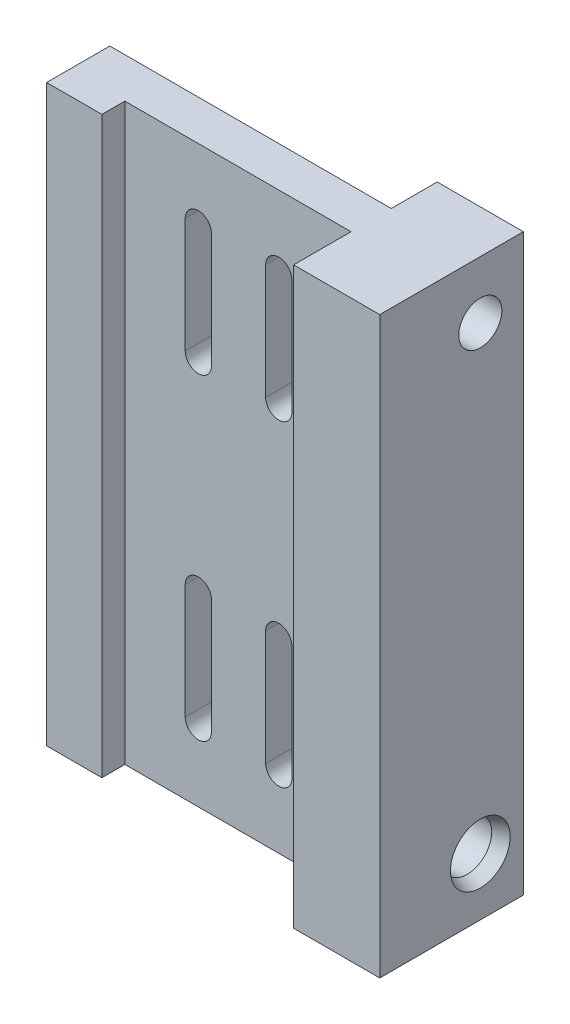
ISO-10303-21;
HEADER;
FILE_DESCRIPTION(('STEP AP214'),'2;1');
FILE_NAME('part.step','',(''),(''),'','','');
FILE_SCHEMA(('AUTOMOTIVE_DESIGN { 1 0 10303 214 1 1 1 1 }'));
ENDSEC;
DATA;
#1=APPLICATION_CONTEXT('core data for automotive mechanical design processes');
#2=APPLICATION_PROTOCOL_DEFINITION('international standard','automotive_design',2000,#1);
#3=PRODUCT_CONTEXT('',#1,'mechanical');
#4=PRODUCT('Part','Part','',(#3));
#5=PRODUCT_RELATED_PRODUCT_CATEGORY('part','',(#4));
#6=PRODUCT_DEFINITION_FORMATION('','',#4);
#7=PRODUCT_DEFINITION_CONTEXT('part definition',#1,'design');
#8=PRODUCT_DEFINITION('design','',#6,#7);
#9=PRODUCT_DEFINITION_SHAPE('','',#8);
#10=(LENGTH_UNIT() NAMED_UNIT(*) SI_UNIT(.MILLI.,.METRE.));
#11=(NAMED_UNIT(*) PLANE_ANGLE_UNIT() SI_UNIT($,.RADIAN.));
#12=(NAMED_UNIT(*) SI_UNIT($,.STERADIAN.) SOLID_ANGLE_UNIT());
#13=UNCERTAINTY_MEASURE_WITH_UNIT(LENGTH_MEASURE(1.E-05),#10,'distance_accuracy_value','');
#14=(GEOMETRIC_REPRESENTATION_CONTEXT(3) GLOBAL_UNCERTAINTY_ASSIGNED_CONTEXT((#13)) GLOBAL_UNIT_ASSIGNED_CONTEXT((#10,
#11,#12)) REPRESENTATION_CONTEXT('',''));
#15=CARTESIAN_POINT('',(0.,0.,0.));
#16=DIRECTION('',(0.,0.,1.));
#17=DIRECTION('',(1.,0.,0.));
#18=AXIS2_PLACEMENT_3D('',#15,#16,#17);
#19=CARTESIAN_POINT('',(-14.22869011,14.224,15.875));
#20=DIRECTION('',(0.,-1.,0.));
#21=DIRECTION('',(1.,0.,0.));
#22=AXIS2_PLACEMENT_3D('',#19,#20,#21);
#23=PLANE('',#22);
#24=DIRECTION('',(-1.,0.,0.));
#25=VECTOR('',#24,1.);
#26=CARTESIAN_POINT('',(-14.22869011,14.224,12.065));
#27=LINE('',#26,#25);
#28=CARTESIAN_POINT('',(-8.12131011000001,14.224,12.065));
#29=VERTEX_POINT('',#28);
#30=CARTESIAN_POINT('',(-14.22869011,14.224,12.065));
#31=VERTEX_POINT('',#30);
#32=EDGE_CURVE('E234',#29,#31,#27,.T.);
#33=ORIENTED_EDGE('',*,*,#32,.F.);
#34=DIRECTION('',(0.,0.,1.));
#35=VECTOR('',#34,1.);
#36=CARTESIAN_POINT('',(-8.12131011,14.224,15.875));
#37=LINE('',#36,#35);
#38=CARTESIAN_POINT('',(-8.12131011,14.224,9.525));
#39=VERTEX_POINT('',#38);
#40=EDGE_CURVE('E388',#39,#29,#37,.T.);
#41=ORIENTED_EDGE('',*,*,#40,.F.);
#42=DIRECTION('',(-1.,0.,0.));
#43=VECTOR('',#42,1.);
#44=CARTESIAN_POINT('',(-8.12131011,14.224,9.525));
#45=LINE('',#44,#43);
#46=CARTESIAN_POINT('',(16.87868989,14.224,9.525));
#47=VERTEX_POINT('',#46);
#48=EDGE_CURVE('E397',#47,#39,#45,.T.);
#49=ORIENTED_EDGE('',*,*,#48,.F.);
#50=DIRECTION('',(0.,0.,-1.));
#51=VECTOR('',#50,1.);
#52=CARTESIAN_POINT('',(16.87868989,14.224,15.875));
#53=LINE('',#52,#51);
#54=CARTESIAN_POINT('',(16.87868989,14.224,15.875));
#55=VERTEX_POINT('',#54);
#56=EDGE_CURVE('E393',#55,#47,#53,.T.);
#57=ORIENTED_EDGE('',*,*,#56,.F.);
#58=DIRECTION('',(-1.,0.,0.));
#59=VECTOR('',#58,1.);
#60=CARTESIAN_POINT('',(-14.22869011,14.224,15.875));
#61=LINE('',#60,#59);
#62=CARTESIAN_POINT('',(26.40368989,14.224,15.875));
#63=VERTEX_POINT('',#62);
#64=EDGE_CURVE('E493',#63,#55,#61,.T.);
#65=ORIENTED_EDGE('',*,*,#64,.F.);
#66=DIRECTION('',(0.,0.,-1.));
#67=VECTOR('',#66,1.);
#68=CARTESIAN_POINT('',(26.40368989,14.224,15.875));
#69=LINE('',#68,#67);
#70=CARTESIAN_POINT('',(26.40368989,14.224,0.));
#71=VERTEX_POINT('',#70);
#72=EDGE_CURVE('E257',#63,#71,#69,.T.);
#73=ORIENTED_EDGE('',*,*,#72,.T.);
#74=DIRECTION('',(-1.,0.,0.));
#75=VECTOR('',#74,1.);
#76=CARTESIAN_POINT('',(-14.22869011,14.224,0.));
#77=LINE('',#76,#75);
#78=CARTESIAN_POINT('',(16.87868989,14.224,0.));
#79=VERTEX_POINT('',#78);
#80=EDGE_CURVE('E500',#71,#79,#77,.T.);
#81=ORIENTED_EDGE('',*,*,#80,.T.);
#82=DIRECTION('',(0.,0.,-1.));
#83=VECTOR('',#82,1.);
#84=CARTESIAN_POINT('',(16.87868989,14.224,0.));
#85=LINE('',#84,#83);
#86=CARTESIAN_POINT('',(16.87868989,14.224,5.08));
#87=VERTEX_POINT('',#86);
#88=EDGE_CURVE('E560',#87,#79,#85,.T.);
#89=ORIENTED_EDGE('',*,*,#88,.F.);
#90=DIRECTION('',(1.,0.,0.));
#91=VECTOR('',#90,1.);
#92=CARTESIAN_POINT('',(16.87868989,14.224,5.08));
#93=LINE('',#92,#91);
#94=CARTESIAN_POINT('',(-14.22869011,14.224,5.08));
#95=VERTEX_POINT('',#94);
#96=EDGE_CURVE('E557',#95,#87,#93,.T.);
#97=ORIENTED_EDGE('',*,*,#96,.F.);
#98=DIRECTION('',(0.,0.,-1.));
#99=VECTOR('',#98,1.);
#100=CARTESIAN_POINT('',(-14.22869011,14.224,15.875));
#101=LINE('',#100,#99);
#102=EDGE_CURVE('E254',#31,#95,#101,.T.);
#103=ORIENTED_EDGE('',*,*,#102,.F.);
#104=EDGE_LOOP('',(#33,#41,#49,#57,#65,#73,#81,#89,#97,#103));
#105=FACE_BOUND('',#104,.T.);
#106=ADVANCED_FACE('F42',(#105),#23,.F.);
#107=CARTESIAN_POINT('',(-14.22869011,14.224,15.875));
#108=DIRECTION('',(1.,0.,0.));
#109=DIRECTION('',(0.,1.,0.));
#110=AXIS2_PLACEMENT_3D('',#107,#108,#109);
#111=PLANE('',#110);
#112=DIRECTION('',(0.,-1.,0.));
#113=VECTOR('',#112,1.);
#114=CARTESIAN_POINT('',(-14.22869011,14.224,12.065));
#115=LINE('',#114,#113);
#116=CARTESIAN_POINT('',(-14.22869011,-49.276,12.065));
#117=VERTEX_POINT('',#116);
#118=EDGE_CURVE('E231',#31,#117,#115,.T.);
#119=ORIENTED_EDGE('',*,*,#118,.F.);
#120=ORIENTED_EDGE('',*,*,#102,.T.);
#121=DIRECTION('',(0.,1.,0.));
#122=VECTOR('',#121,1.);
#123=CARTESIAN_POINT('',(-14.22869011,-49.276,5.08));
#124=LINE('',#123,#122);
#125=CARTESIAN_POINT('',(-14.22869011,-49.276,5.08));
#126=VERTEX_POINT('',#125);
#127=EDGE_CURVE('E253',#126,#95,#124,.T.);
#128=ORIENTED_EDGE('',*,*,#127,.F.);
#129=DIRECTION('',(0.,0.,-1.));
#130=VECTOR('',#129,1.);
#131=CARTESIAN_POINT('',(-14.22869011,-49.276,15.875));
#132=LINE('',#131,#130);
#133=EDGE_CURVE('E243',#117,#126,#132,.T.);
#134=ORIENTED_EDGE('',*,*,#133,.F.);
#135=EDGE_LOOP('',(#119,#120,#128,#134));
#136=FACE_BOUND('',#135,.T.);
#137=ADVANCED_FACE('F251',(#136),#111,.F.);
#138=CARTESIAN_POINT('',(-14.22869011,-49.276,15.875));
#139=DIRECTION('',(0.,1.,0.));
#140=DIRECTION('',(-1.,0.,0.));
#141=AXIS2_PLACEMENT_3D('',#138,#139,#140);
#142=PLANE('',#141);
#143=DIRECTION('',(1.,0.,0.));
#144=VECTOR('',#143,1.);
#145=CARTESIAN_POINT('',(-14.22869011,-49.276,12.065));
#146=LINE('',#145,#144);
#147=CARTESIAN_POINT('',(-8.12131011,-49.276,12.065));
#148=VERTEX_POINT('',#147);
#149=EDGE_CURVE('E57',#117,#148,#146,.T.);
#150=ORIENTED_EDGE('',*,*,#149,.F.);
#151=ORIENTED_EDGE('',*,*,#133,.T.);
#152=DIRECTION('',(1.,0.,0.));
#153=VECTOR('',#152,1.);
#154=CARTESIAN_POINT('',(16.87868989,-49.276,5.08));
#155=LINE('',#154,#153);
#156=CARTESIAN_POINT('',(16.87868989,-49.276,5.08));
#157=VERTEX_POINT('',#156);
#158=EDGE_CURVE('E550',#126,#157,#155,.T.);
#159=ORIENTED_EDGE('',*,*,#158,.T.);
#160=DIRECTION('',(0.,0.,-1.));
#161=VECTOR('',#160,1.);
#162=CARTESIAN_POINT('',(16.87868989,-49.276,0.));
#163=LINE('',#162,#161);
#164=CARTESIAN_POINT('',(16.87868989,-49.276,0.));
#165=VERTEX_POINT('',#164);
#166=EDGE_CURVE('E507',#157,#165,#163,.T.);
#167=ORIENTED_EDGE('',*,*,#166,.T.);
#168=DIRECTION('',(1.,0.,0.));
#169=VECTOR('',#168,1.);
#170=CARTESIAN_POINT('',(-14.22869011,-49.276,0.));
#171=LINE('',#170,#169);
#172=CARTESIAN_POINT('',(26.40368989,-49.276,0.));
#173=VERTEX_POINT('',#172);
#174=EDGE_CURVE('E494',#165,#173,#171,.T.);
#175=ORIENTED_EDGE('',*,*,#174,.T.);
#176=DIRECTION('',(0.,0.,-1.));
#177=VECTOR('',#176,1.);
#178=CARTESIAN_POINT('',(26.40368989,-49.276,15.875));
#179=LINE('',#178,#177);
#180=CARTESIAN_POINT('',(26.40368989,-49.276,15.875));
#181=VERTEX_POINT('',#180);
#182=EDGE_CURVE('E255',#181,#173,#179,.T.);
#183=ORIENTED_EDGE('',*,*,#182,.F.);
#184=DIRECTION('',(1.,0.,0.));
#185=VECTOR('',#184,1.);
#186=CARTESIAN_POINT('',(-14.22869011,-49.276,15.875));
#187=LINE('',#186,#185);
#188=CARTESIAN_POINT('',(16.87868989,-49.276,15.875));
#189=VERTEX_POINT('',#188);
#190=EDGE_CURVE('E260',#189,#181,#187,.T.);
#191=ORIENTED_EDGE('',*,*,#190,.F.);
#192=DIRECTION('',(0.,0.,-1.));
#193=VECTOR('',#192,1.);
#194=CARTESIAN_POINT('',(16.87868989,-49.276,15.875));
#195=LINE('',#194,#193);
#196=CARTESIAN_POINT('',(16.87868989,-49.276,9.525));
#197=VERTEX_POINT('',#196);
#198=EDGE_CURVE('E517',#189,#197,#195,.T.);
#199=ORIENTED_EDGE('',*,*,#198,.T.);
#200=DIRECTION('',(-1.,0.,0.));
#201=VECTOR('',#200,1.);
#202=CARTESIAN_POINT('',(-8.12131011,-49.276,9.525));
#203=LINE('',#202,#201);
#204=CARTESIAN_POINT('',(-8.12131011,-49.276,9.525));
#205=VERTEX_POINT('',#204);
#206=EDGE_CURVE('E402',#197,#205,#203,.T.);
#207=ORIENTED_EDGE('',*,*,#206,.T.);
#208=DIRECTION('',(0.,0.,1.));
#209=VECTOR('',#208,1.);
#210=CARTESIAN_POINT('',(-8.12131011,-49.276,15.875));
#211=LINE('',#210,#209);
#212=EDGE_CURVE('E247',#205,#148,#211,.T.);
#213=ORIENTED_EDGE('',*,*,#212,.T.);
#214=EDGE_LOOP('',(#150,#151,#159,#167,#175,#183,#191,#199,#207,#213));
#215=FACE_BOUND('',#214,.T.);
#216=ADVANCED_FACE('F241',(#215),#142,.F.);
#217=CARTESIAN_POINT('',(-8.12131011,-49.276,15.875));
#218=DIRECTION('',(-1.,0.,0.));
#219=DIRECTION('',(0.,0.,1.));
#220=AXIS2_PLACEMENT_3D('',#217,#218,#219);
#221=PLANE('',#220);
#222=DIRECTION('',(0.,1.,0.));
#223=VECTOR('',#222,1.);
#224=CARTESIAN_POINT('',(-8.12131011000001,14.224,12.065));
#225=LINE('',#224,#223);
#226=EDGE_CURVE('E248',#148,#29,#225,.T.);
#227=ORIENTED_EDGE('',*,*,#226,.F.);
#228=ORIENTED_EDGE('',*,*,#212,.F.);
#229=DIRECTION('',(0.,1.,0.));
#230=VECTOR('',#229,1.);
#231=CARTESIAN_POINT('',(-8.12131011,-49.276,9.525));
#232=LINE('',#231,#230);
#233=EDGE_CURVE('E391',#205,#39,#232,.T.);
#234=ORIENTED_EDGE('',*,*,#233,.T.);
#235=ORIENTED_EDGE('',*,*,#40,.T.);
#236=EDGE_LOOP('',(#227,#228,#234,#235));
#237=FACE_BOUND('',#236,.T.);
#238=ADVANCED_FACE('F303',(#237),#221,.F.);
#239=CARTESIAN_POINT('',(26.40368989,-49.276,15.875));
#240=DIRECTION('',(0.,0.,1.));
#241=DIRECTION('',(1.,0.,0.));
#242=AXIS2_PLACEMENT_3D('',#239,#240,#241);
#243=PLANE('',#242);
#244=DIRECTION('',(0.,1.,0.));
#245=VECTOR('',#244,1.);
#246=CARTESIAN_POINT('',(16.87868989,-49.276,15.875));
#247=LINE('',#246,#245);
#248=EDGE_CURVE('E410',#189,#55,#247,.T.);
#249=ORIENTED_EDGE('',*,*,#248,.F.);
#250=ORIENTED_EDGE('',*,*,#190,.T.);
#251=DIRECTION('',(0.,1.,0.));
#252=VECTOR('',#251,1.);
#253=CARTESIAN_POINT('',(26.40368989,14.224,15.875));
#254=LINE('',#253,#252);
#255=EDGE_CURVE('E490',#181,#63,#254,.T.);
#256=ORIENTED_EDGE('',*,*,#255,.T.);
#257=ORIENTED_EDGE('',*,*,#64,.T.);
#258=EDGE_LOOP('',(#249,#250,#256,#257));
#259=FACE_BOUND('',#258,.T.);
#260=ADVANCED_FACE('F306',(#259),#243,.T.);
#261=CARTESIAN_POINT('',(26.40368989,-49.276,0.));
#262=DIRECTION('',(0.,0.,1.));
#263=DIRECTION('',(1.,0.,0.));
#264=AXIS2_PLACEMENT_3D('',#261,#262,#263);
#265=PLANE('',#264);
#266=ORIENTED_EDGE('',*,*,#174,.F.);
#267=DIRECTION('',(0.,1.,0.));
#268=VECTOR('',#267,1.);
#269=CARTESIAN_POINT('',(16.87868989,-49.276,0.));
#270=LINE('',#269,#268);
#271=EDGE_CURVE('E512',#165,#79,#270,.T.);
#272=ORIENTED_EDGE('',*,*,#271,.T.);
#273=ORIENTED_EDGE('',*,*,#80,.F.);
#274=DIRECTION('',(0.,1.,0.));
#275=VECTOR('',#274,1.);
#276=CARTESIAN_POINT('',(26.40368989,14.224,0.));
#277=LINE('',#276,#275);
#278=EDGE_CURVE('E489',#173,#71,#277,.T.);
#279=ORIENTED_EDGE('',*,*,#278,.F.);
#280=EDGE_LOOP('',(#266,#272,#273,#279));
#281=FACE_BOUND('',#280,.T.);
#282=ADVANCED_FACE('F373',(#281),#265,.F.);
#283=CARTESIAN_POINT('',(26.40368989,14.224,15.875));
#284=DIRECTION('',(-1.,0.,0.));
#285=DIRECTION('',(0.,-1.,0.));
#286=AXIS2_PLACEMENT_3D('',#283,#284,#285);
#287=PLANE('',#286);
#288=CARTESIAN_POINT('',(26.40368989,-42.926,4.7625));
#289=DIRECTION('',(1.,0.,0.));
#290=DIRECTION('',(0.,0.,-1.));
#291=AXIS2_PLACEMENT_3D('',#288,#289,#290);
#292=CIRCLE('',#291,3.302);
#293=CARTESIAN_POINT('',(26.40368989,-42.926,1.4605));
#294=VERTEX_POINT('',#293);
#295=EDGE_CURVE('E574',#294,#294,#292,.T.);
#296=ORIENTED_EDGE('',*,*,#295,.F.);
#297=EDGE_LOOP('',(#296));
#298=FACE_BOUND('',#297,.T.);
#299=CARTESIAN_POINT('',(26.40368989,7.874,4.7625));
#300=DIRECTION('',(1.,0.,0.));
#301=DIRECTION('',(0.,1.,0.));
#302=AXIS2_PLACEMENT_3D('',#299,#300,#301);
#303=CIRCLE('',#302,2.38125);
#304=CARTESIAN_POINT('',(26.40368989,10.25525,4.7625));
#305=VERTEX_POINT('',#304);
#306=EDGE_CURVE('E568',#305,#305,#303,.T.);
#307=ORIENTED_EDGE('',*,*,#306,.F.);
#308=EDGE_LOOP('',(#307));
#309=FACE_BOUND('',#308,.T.);
#310=ORIENTED_EDGE('',*,*,#278,.T.);
#311=ORIENTED_EDGE('',*,*,#72,.F.);
#312=ORIENTED_EDGE('',*,*,#255,.F.);
#313=ORIENTED_EDGE('',*,*,#182,.T.);
#314=EDGE_LOOP('',(#310,#311,#312,#313));
#315=FACE_BOUND('',#314,.T.);
#316=ADVANCED_FACE('F44',(#298,#309,#315),#287,.F.);
#317=CARTESIAN_POINT('',(8.890000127,6.35,15.875));
#318=DIRECTION('',(0.,0.,-1.));
#319=DIRECTION('',(-1.,0.,0.));
#320=AXIS2_PLACEMENT_3D('',#317,#318,#319);
#321=CYLINDRICAL_SURFACE('',#320,1.450000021);
#322=CARTESIAN_POINT('',(8.890000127,6.35,5.08));
#323=DIRECTION('',(0.,0.,1.));
#324=DIRECTION('',(1.,0.,0.));
#325=AXIS2_PLACEMENT_3D('',#322,#323,#324);
#326=CIRCLE('',#325,1.450000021);
#327=CARTESIAN_POINT('',(10.340000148,6.35,5.08));
#328=VERTEX_POINT('',#327);
#329=CARTESIAN_POINT('',(7.440000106,6.35,5.08));
#330=VERTEX_POINT('',#329);
#331=EDGE_CURVE('E394',#328,#330,#326,.T.);
#332=ORIENTED_EDGE('',*,*,#331,.F.);
#333=DIRECTION('',(0.,0.,-1.));
#334=VECTOR('',#333,1.);
#335=CARTESIAN_POINT('',(10.340000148,6.35,15.875));
#336=LINE('',#335,#334);
#337=CARTESIAN_POINT('',(10.340000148,6.35,9.525));
#338=VERTEX_POINT('',#337);
#339=EDGE_CURVE('E477',#338,#328,#336,.T.);
#340=ORIENTED_EDGE('',*,*,#339,.F.);
#341=CARTESIAN_POINT('',(8.890000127,6.35,9.525));
#342=DIRECTION('',(0.,0.,-1.));
#343=DIRECTION('',(-1.,0.,0.));
#344=AXIS2_PLACEMENT_3D('',#341,#342,#343);
#345=CIRCLE('',#344,1.450000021);
#346=CARTESIAN_POINT('',(7.440000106,6.35,9.525));
#347=VERTEX_POINT('',#346);
#348=EDGE_CURVE('E439',#347,#338,#345,.T.);
#349=ORIENTED_EDGE('',*,*,#348,.F.);
#350=DIRECTION('',(0.,0.,-1.));
#351=VECTOR('',#350,1.);
#352=CARTESIAN_POINT('',(7.440000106,6.35,15.875));
#353=LINE('',#352,#351);
#354=EDGE_CURVE('E486',#347,#330,#353,.T.);
#355=ORIENTED_EDGE('',*,*,#354,.T.);
#356=EDGE_LOOP('',(#332,#340,#349,#355));
#357=FACE_BOUND('',#356,.T.);
#358=ADVANCED_FACE('F366',(#357),#321,.F.);
#359=CARTESIAN_POINT('',(7.440000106,6.35,15.875));
#360=DIRECTION('',(1.,0.,0.));
#361=DIRECTION('',(0.,0.,-1.));
#362=AXIS2_PLACEMENT_3D('',#359,#360,#361);
#363=PLANE('',#362);
#364=DIRECTION('',(0.,-1.,0.));
#365=VECTOR('',#364,1.);
#366=CARTESIAN_POINT('',(7.440000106,6.35,5.08));
#367=LINE('',#366,#365);
#368=CARTESIAN_POINT('',(7.440000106,-6.35,5.08));
#369=VERTEX_POINT('',#368);
#370=EDGE_CURVE('E399',#330,#369,#367,.T.);
#371=ORIENTED_EDGE('',*,*,#370,.F.);
#372=ORIENTED_EDGE('',*,*,#354,.F.);
#373=DIRECTION('',(0.,1.,0.));
#374=VECTOR('',#373,1.);
#375=CARTESIAN_POINT('',(7.440000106,6.35,9.525));
#376=LINE('',#375,#374);
#377=CARTESIAN_POINT('',(7.440000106,-6.35,9.525));
#378=VERTEX_POINT('',#377);
#379=EDGE_CURVE('E437',#378,#347,#376,.T.);
#380=ORIENTED_EDGE('',*,*,#379,.F.);
#381=DIRECTION('',(0.,0.,-1.));
#382=VECTOR('',#381,1.);
#383=CARTESIAN_POINT('',(7.440000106,-6.35,15.875));
#384=LINE('',#383,#382);
#385=EDGE_CURVE('E483',#378,#369,#384,.T.);
#386=ORIENTED_EDGE('',*,*,#385,.T.);
#387=EDGE_LOOP('',(#371,#372,#380,#386));
#388=FACE_BOUND('',#387,.T.);
#389=ADVANCED_FACE('F362',(#388),#363,.T.);
#390=CARTESIAN_POINT('',(8.890000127,-6.35,15.875));
#391=DIRECTION('',(0.,0.,-1.));
#392=DIRECTION('',(-1.,0.,0.));
#393=AXIS2_PLACEMENT_3D('',#390,#391,#392);
#394=CYLINDRICAL_SURFACE('',#393,1.450000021);
#395=CARTESIAN_POINT('',(8.890000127,-6.35,5.08));
#396=DIRECTION('',(0.,0.,1.));
#397=DIRECTION('',(1.,0.,0.));
#398=AXIS2_PLACEMENT_3D('',#395,#396,#397);
#399=CIRCLE('',#398,1.450000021);
#400=CARTESIAN_POINT('',(10.340000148,-6.35,5.08));
#401=VERTEX_POINT('',#400);
#402=EDGE_CURVE('E522',#369,#401,#399,.T.);
#403=ORIENTED_EDGE('',*,*,#402,.F.);
#404=ORIENTED_EDGE('',*,*,#385,.F.);
#405=CARTESIAN_POINT('',(8.890000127,-6.35,9.525));
#406=DIRECTION('',(0.,0.,-1.));
#407=DIRECTION('',(-1.,0.,0.));
#408=AXIS2_PLACEMENT_3D('',#405,#406,#407);
#409=CIRCLE('',#408,1.450000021);
#410=CARTESIAN_POINT('',(10.340000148,-6.35,9.525));
#411=VERTEX_POINT('',#410);
#412=EDGE_CURVE('E435',#411,#378,#409,.T.);
#413=ORIENTED_EDGE('',*,*,#412,.F.);
#414=DIRECTION('',(0.,0.,-1.));
#415=VECTOR('',#414,1.);
#416=CARTESIAN_POINT('',(10.340000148,-6.35,15.875));
#417=LINE('',#416,#415);
#418=EDGE_CURVE('E480',#411,#401,#417,.T.);
#419=ORIENTED_EDGE('',*,*,#418,.T.);
#420=EDGE_LOOP('',(#403,#404,#413,#419));
#421=FACE_BOUND('',#420,.T.);
#422=ADVANCED_FACE('F358',(#421),#394,.F.);
#423=CARTESIAN_POINT('',(10.340000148,6.35,15.875));
#424=DIRECTION('',(-1.,0.,0.));
#425=DIRECTION('',(0.,0.,1.));
#426=AXIS2_PLACEMENT_3D('',#423,#424,#425);
#427=PLANE('',#426);
#428=DIRECTION('',(0.,1.,0.));
#429=VECTOR('',#428,1.);
#430=CARTESIAN_POINT('',(10.340000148,6.35,5.08));
#431=LINE('',#430,#429);
#432=EDGE_CURVE('E524',#401,#328,#431,.T.);
#433=ORIENTED_EDGE('',*,*,#432,.F.);
#434=ORIENTED_EDGE('',*,*,#418,.F.);
#435=DIRECTION('',(0.,-1.,0.));
#436=VECTOR('',#435,1.);
#437=CARTESIAN_POINT('',(10.340000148,6.35,9.525));
#438=LINE('',#437,#436);
#439=EDGE_CURVE('E433',#338,#411,#438,.T.);
#440=ORIENTED_EDGE('',*,*,#439,.F.);
#441=ORIENTED_EDGE('',*,*,#339,.T.);
#442=EDGE_LOOP('',(#433,#434,#440,#441));
#443=FACE_BOUND('',#442,.T.);
#444=ADVANCED_FACE('F354',(#443),#427,.T.);
#445=CARTESIAN_POINT('',(1.27000368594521E-07,-28.702,15.875));
#446=DIRECTION('',(0.,0.,-1.));
#447=DIRECTION('',(-1.,0.,0.));
#448=AXIS2_PLACEMENT_3D('',#445,#446,#447);
#449=CYLINDRICAL_SURFACE('',#448,1.450000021);
#450=CARTESIAN_POINT('',(1.27000368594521E-07,-28.702,5.08));
#451=DIRECTION('',(0.,0.,1.));
#452=DIRECTION('',(1.,0.,0.));
#453=AXIS2_PLACEMENT_3D('',#450,#451,#452);
#454=CIRCLE('',#453,1.450000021);
#455=CARTESIAN_POINT('',(1.45000014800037,-28.702,5.08));
#456=VERTEX_POINT('',#455);
#457=CARTESIAN_POINT('',(-1.44999989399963,-28.702,5.08));
#458=VERTEX_POINT('',#457);
#459=EDGE_CURVE('E526',#456,#458,#454,.T.);
#460=ORIENTED_EDGE('',*,*,#459,.F.);
#461=DIRECTION('',(0.,0.,-1.));
#462=VECTOR('',#461,1.);
#463=CARTESIAN_POINT('',(1.45000014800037,-28.702,15.875));
#464=LINE('',#463,#462);
#465=CARTESIAN_POINT('',(1.45000014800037,-28.702,9.525));
#466=VERTEX_POINT('',#465);
#467=EDGE_CURVE('E465',#466,#456,#464,.T.);
#468=ORIENTED_EDGE('',*,*,#467,.F.);
#469=CARTESIAN_POINT('',(1.27000368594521E-07,-28.702,9.525));
#470=DIRECTION('',(0.,0.,-1.));
#471=DIRECTION('',(-1.,0.,0.));
#472=AXIS2_PLACEMENT_3D('',#469,#470,#471);
#473=CIRCLE('',#472,1.450000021);
#474=CARTESIAN_POINT('',(-1.44999989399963,-28.702,9.525));
#475=VERTEX_POINT('',#474);
#476=EDGE_CURVE('E431',#475,#466,#473,.T.);
#477=ORIENTED_EDGE('',*,*,#476,.F.);
#478=DIRECTION('',(0.,0.,-1.));
#479=VECTOR('',#478,1.);
#480=CARTESIAN_POINT('',(-1.44999989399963,-28.702,15.875));
#481=LINE('',#480,#479);
#482=EDGE_CURVE('E474',#475,#458,#481,.T.);
#483=ORIENTED_EDGE('',*,*,#482,.T.);
#484=EDGE_LOOP('',(#460,#468,#477,#483));
#485=FACE_BOUND('',#484,.T.);
#486=ADVANCED_FACE('F350',(#485),#449,.F.);
#487=CARTESIAN_POINT('',(-1.44999989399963,-28.702,15.875));
#488=DIRECTION('',(1.,0.,0.));
#489=DIRECTION('',(0.,0.,-1.));
#490=AXIS2_PLACEMENT_3D('',#487,#488,#489);
#491=PLANE('',#490);
#492=DIRECTION('',(0.,-1.,0.));
#493=VECTOR('',#492,1.);
#494=CARTESIAN_POINT('',(-1.44999989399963,-28.702,5.08));
#495=LINE('',#494,#493);
#496=CARTESIAN_POINT('',(-1.44999989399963,-41.402,5.08));
#497=VERTEX_POINT('',#496);
#498=EDGE_CURVE('E528',#458,#497,#495,.T.);
#499=ORIENTED_EDGE('',*,*,#498,.F.);
#500=ORIENTED_EDGE('',*,*,#482,.F.);
#501=DIRECTION('',(0.,1.,0.));
#502=VECTOR('',#501,1.);
#503=CARTESIAN_POINT('',(-1.44999989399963,-28.702,9.525));
#504=LINE('',#503,#502);
#505=CARTESIAN_POINT('',(-1.44999989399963,-41.402,9.525));
#506=VERTEX_POINT('',#505);
#507=EDGE_CURVE('E429',#506,#475,#504,.T.);
#508=ORIENTED_EDGE('',*,*,#507,.F.);
#509=DIRECTION('',(0.,0.,-1.));
#510=VECTOR('',#509,1.);
#511=CARTESIAN_POINT('',(-1.44999989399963,-41.402,15.875));
#512=LINE('',#511,#510);
#513=EDGE_CURVE('E471',#506,#497,#512,.T.);
#514=ORIENTED_EDGE('',*,*,#513,.T.);
#515=EDGE_LOOP('',(#499,#500,#508,#514));
#516=FACE_BOUND('',#515,.T.);
#517=ADVANCED_FACE('F346',(#516),#491,.T.);
#518=CARTESIAN_POINT('',(1.27000368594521E-07,-41.402,15.875));
#519=DIRECTION('',(0.,0.,-1.));
#520=DIRECTION('',(-1.,0.,0.));
#521=AXIS2_PLACEMENT_3D('',#518,#519,#520);
#522=CYLINDRICAL_SURFACE('',#521,1.450000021);
#523=CARTESIAN_POINT('',(1.27000368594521E-07,-41.402,5.08));
#524=DIRECTION('',(0.,0.,1.));
#525=DIRECTION('',(1.,0.,0.));
#526=AXIS2_PLACEMENT_3D('',#523,#524,#525);
#527=CIRCLE('',#526,1.450000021);
#528=CARTESIAN_POINT('',(1.45000014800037,-41.402,5.08));
#529=VERTEX_POINT('',#528);
#530=EDGE_CURVE('E530',#497,#529,#527,.T.);
#531=ORIENTED_EDGE('',*,*,#530,.F.);
#532=ORIENTED_EDGE('',*,*,#513,.F.);
#533=CARTESIAN_POINT('',(1.27000368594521E-07,-41.402,9.525));
#534=DIRECTION('',(0.,0.,-1.));
#535=DIRECTION('',(-1.,0.,0.));
#536=AXIS2_PLACEMENT_3D('',#533,#534,#535);
#537=CIRCLE('',#536,1.450000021);
#538=CARTESIAN_POINT('',(1.45000014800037,-41.402,9.525));
#539=VERTEX_POINT('',#538);
#540=EDGE_CURVE('E427',#539,#506,#537,.T.);
#541=ORIENTED_EDGE('',*,*,#540,.F.);
#542=DIRECTION('',(0.,0.,-1.));
#543=VECTOR('',#542,1.);
#544=CARTESIAN_POINT('',(1.45000014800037,-41.402,15.875));
#545=LINE('',#544,#543);
#546=EDGE_CURVE('E468',#539,#529,#545,.T.);
#547=ORIENTED_EDGE('',*,*,#546,.T.);
#548=EDGE_LOOP('',(#531,#532,#541,#547));
#549=FACE_BOUND('',#548,.T.);
#550=ADVANCED_FACE('F342',(#549),#522,.F.);
#551=CARTESIAN_POINT('',(1.45000014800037,-28.702,15.875));
#552=DIRECTION('',(-1.,0.,0.));
#553=DIRECTION('',(0.,0.,1.));
#554=AXIS2_PLACEMENT_3D('',#551,#552,#553);
#555=PLANE('',#554);
#556=DIRECTION('',(0.,1.,0.));
#557=VECTOR('',#556,1.);
#558=CARTESIAN_POINT('',(1.45000014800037,-28.702,5.08));
#559=LINE('',#558,#557);
#560=EDGE_CURVE('E532',#529,#456,#559,.T.);
#561=ORIENTED_EDGE('',*,*,#560,.F.);
#562=ORIENTED_EDGE('',*,*,#546,.F.);
#563=DIRECTION('',(0.,-1.,0.));
#564=VECTOR('',#563,1.);
#565=CARTESIAN_POINT('',(1.45000014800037,-28.702,9.525));
#566=LINE('',#565,#564);
#567=EDGE_CURVE('E425',#466,#539,#566,.T.);
#568=ORIENTED_EDGE('',*,*,#567,.F.);
#569=ORIENTED_EDGE('',*,*,#467,.T.);
#570=EDGE_LOOP('',(#561,#562,#568,#569));
#571=FACE_BOUND('',#570,.T.);
#572=ADVANCED_FACE('F338',(#571),#555,.T.);
#573=CARTESIAN_POINT('',(1.27000001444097E-07,6.35,15.875));
#574=DIRECTION('',(0.,0.,-1.));
#575=DIRECTION('',(-1.,0.,0.));
#576=AXIS2_PLACEMENT_3D('',#573,#574,#575);
#577=CYLINDRICAL_SURFACE('',#576,1.450000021);
#578=CARTESIAN_POINT('',(1.27000001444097E-07,6.35,5.08));
#579=DIRECTION('',(0.,0.,1.));
#580=DIRECTION('',(1.,0.,0.));
#581=AXIS2_PLACEMENT_3D('',#578,#579,#580);
#582=CIRCLE('',#581,1.450000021);
#583=CARTESIAN_POINT('',(1.450000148,6.35,5.08));
#584=VERTEX_POINT('',#583);
#585=CARTESIAN_POINT('',(-1.449999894,6.35,5.08));
#586=VERTEX_POINT('',#585);
#587=EDGE_CURVE('E534',#584,#586,#582,.T.);
#588=ORIENTED_EDGE('',*,*,#587,.F.);
#589=DIRECTION('',(0.,0.,-1.));
#590=VECTOR('',#589,1.);
#591=CARTESIAN_POINT('',(1.450000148,6.35,15.875));
#592=LINE('',#591,#590);
#593=CARTESIAN_POINT('',(1.450000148,6.35,9.525));
#594=VERTEX_POINT('',#593);
#595=EDGE_CURVE('E453',#594,#584,#592,.T.);
#596=ORIENTED_EDGE('',*,*,#595,.F.);
#597=CARTESIAN_POINT('',(1.27000001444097E-07,6.35,9.525));
#598=DIRECTION('',(0.,0.,-1.));
#599=DIRECTION('',(-1.,0.,0.));
#600=AXIS2_PLACEMENT_3D('',#597,#598,#599);
#601=CIRCLE('',#600,1.450000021);
#602=CARTESIAN_POINT('',(-1.449999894,6.35,9.525));
#603=VERTEX_POINT('',#602);
#604=EDGE_CURVE('E423',#603,#594,#601,.T.);
#605=ORIENTED_EDGE('',*,*,#604,.F.);
#606=DIRECTION('',(0.,0.,-1.));
#607=VECTOR('',#606,1.);
#608=CARTESIAN_POINT('',(-1.449999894,6.35,15.875));
#609=LINE('',#608,#607);
#610=EDGE_CURVE('E462',#603,#586,#609,.T.);
#611=ORIENTED_EDGE('',*,*,#610,.T.);
#612=EDGE_LOOP('',(#588,#596,#605,#611));
#613=FACE_BOUND('',#612,.T.);
#614=ADVANCED_FACE('F334',(#613),#577,.F.);
#615=CARTESIAN_POINT('',(-1.449999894,6.35,15.875));
#616=DIRECTION('',(1.,0.,0.));
#617=DIRECTION('',(0.,0.,-1.));
#618=AXIS2_PLACEMENT_3D('',#615,#616,#617);
#619=PLANE('',#618);
#620=DIRECTION('',(0.,-1.,0.));
#621=VECTOR('',#620,1.);
#622=CARTESIAN_POINT('',(-1.449999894,6.35,5.08));
#623=LINE('',#622,#621);
#624=CARTESIAN_POINT('',(-1.449999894,-6.35,5.08));
#625=VERTEX_POINT('',#624);
#626=EDGE_CURVE('E536',#586,#625,#623,.T.);
#627=ORIENTED_EDGE('',*,*,#626,.F.);
#628=ORIENTED_EDGE('',*,*,#610,.F.);
#629=DIRECTION('',(0.,1.,0.));
#630=VECTOR('',#629,1.);
#631=CARTESIAN_POINT('',(-1.449999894,6.35,9.525));
#632=LINE('',#631,#630);
#633=CARTESIAN_POINT('',(-1.449999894,-6.35,9.525));
#634=VERTEX_POINT('',#633);
#635=EDGE_CURVE('E421',#634,#603,#632,.T.);
#636=ORIENTED_EDGE('',*,*,#635,.F.);
#637=DIRECTION('',(0.,0.,-1.));
#638=VECTOR('',#637,1.);
#639=CARTESIAN_POINT('',(-1.449999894,-6.35,15.875));
#640=LINE('',#639,#638);
#641=EDGE_CURVE('E459',#634,#625,#640,.T.);
#642=ORIENTED_EDGE('',*,*,#641,.T.);
#643=EDGE_LOOP('',(#627,#628,#636,#642));
#644=FACE_BOUND('',#643,.T.);
#645=ADVANCED_FACE('F330',(#644),#619,.T.);
#646=CARTESIAN_POINT('',(1.27000001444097E-07,-6.35,15.875));
#647=DIRECTION('',(0.,0.,-1.));
#648=DIRECTION('',(-1.,0.,0.));
#649=AXIS2_PLACEMENT_3D('',#646,#647,#648);
#650=CYLINDRICAL_SURFACE('',#649,1.450000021);
#651=CARTESIAN_POINT('',(1.27000001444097E-07,-6.35,5.08));
#652=DIRECTION('',(0.,0.,1.));
#653=DIRECTION('',(1.,0.,0.));
#654=AXIS2_PLACEMENT_3D('',#651,#652,#653);
#655=CIRCLE('',#654,1.450000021);
#656=CARTESIAN_POINT('',(1.450000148,-6.35,5.08));
#657=VERTEX_POINT('',#656);
#658=EDGE_CURVE('E538',#625,#657,#655,.T.);
#659=ORIENTED_EDGE('',*,*,#658,.F.);
#660=ORIENTED_EDGE('',*,*,#641,.F.);
#661=CARTESIAN_POINT('',(1.27000001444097E-07,-6.35,9.525));
#662=DIRECTION('',(0.,0.,-1.));
#663=DIRECTION('',(-1.,0.,0.));
#664=AXIS2_PLACEMENT_3D('',#661,#662,#663);
#665=CIRCLE('',#664,1.450000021);
#666=CARTESIAN_POINT('',(1.450000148,-6.35,9.525));
#667=VERTEX_POINT('',#666);
#668=EDGE_CURVE('E419',#667,#634,#665,.T.);
#669=ORIENTED_EDGE('',*,*,#668,.F.);
#670=DIRECTION('',(0.,0.,-1.));
#671=VECTOR('',#670,1.);
#672=CARTESIAN_POINT('',(1.450000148,-6.35,15.875));
#673=LINE('',#672,#671);
#674=EDGE_CURVE('E456',#667,#657,#673,.T.);
#675=ORIENTED_EDGE('',*,*,#674,.T.);
#676=EDGE_LOOP('',(#659,#660,#669,#675));
#677=FACE_BOUND('',#676,.T.);
#678=ADVANCED_FACE('F326',(#677),#650,.F.);
#679=CARTESIAN_POINT('',(1.450000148,6.35,15.875));
#680=DIRECTION('',(-1.,0.,0.));
#681=DIRECTION('',(0.,0.,1.));
#682=AXIS2_PLACEMENT_3D('',#679,#680,#681);
#683=PLANE('',#682);
#684=DIRECTION('',(0.,1.,0.));
#685=VECTOR('',#684,1.);
#686=CARTESIAN_POINT('',(1.450000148,6.35,5.08));
#687=LINE('',#686,#685);
#688=EDGE_CURVE('E540',#657,#584,#687,.T.);
#689=ORIENTED_EDGE('',*,*,#688,.F.);
#690=ORIENTED_EDGE('',*,*,#674,.F.);
#691=DIRECTION('',(0.,-1.,0.));
#692=VECTOR('',#691,1.);
#693=CARTESIAN_POINT('',(1.450000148,6.35,9.525));
#694=LINE('',#693,#692);
#695=EDGE_CURVE('E417',#594,#667,#694,.T.);
#696=ORIENTED_EDGE('',*,*,#695,.F.);
#697=ORIENTED_EDGE('',*,*,#595,.T.);
#698=EDGE_LOOP('',(#689,#690,#696,#697));
#699=FACE_BOUND('',#698,.T.);
#700=ADVANCED_FACE('F322',(#699),#683,.T.);
#701=CARTESIAN_POINT('',(8.89000012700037,-28.702,15.875));
#702=DIRECTION('',(0.,0.,-1.));
#703=DIRECTION('',(-1.,0.,0.));
#704=AXIS2_PLACEMENT_3D('',#701,#702,#703);
#705=CYLINDRICAL_SURFACE('',#704,1.450000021);
#706=CARTESIAN_POINT('',(8.89000012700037,-28.702,5.08));
#707=DIRECTION('',(0.,0.,1.));
#708=DIRECTION('',(1.,0.,0.));
#709=AXIS2_PLACEMENT_3D('',#706,#707,#708);
#710=CIRCLE('',#709,1.450000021);
#711=CARTESIAN_POINT('',(10.3400001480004,-28.702,5.08));
#712=VERTEX_POINT('',#711);
#713=CARTESIAN_POINT('',(7.44000010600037,-28.702,5.08));
#714=VERTEX_POINT('',#713);
#715=EDGE_CURVE('E542',#712,#714,#710,.T.);
#716=ORIENTED_EDGE('',*,*,#715,.F.);
#717=DIRECTION('',(0.,0.,-1.));
#718=VECTOR('',#717,1.);
#719=CARTESIAN_POINT('',(10.3400001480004,-28.702,15.875));
#720=LINE('',#719,#718);
#721=CARTESIAN_POINT('',(10.3400001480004,-28.702,9.525));
#722=VERTEX_POINT('',#721);
#723=EDGE_CURVE('E441',#722,#712,#720,.T.);
#724=ORIENTED_EDGE('',*,*,#723,.F.);
#725=CARTESIAN_POINT('',(8.89000012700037,-28.702,9.525));
#726=DIRECTION('',(0.,0.,-1.));
#727=DIRECTION('',(-1.,0.,0.));
#728=AXIS2_PLACEMENT_3D('',#725,#726,#727);
#729=CIRCLE('',#728,1.450000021);
#730=CARTESIAN_POINT('',(7.44000010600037,-28.702,9.525));
#731=VERTEX_POINT('',#730);
#732=EDGE_CURVE('E415',#731,#722,#729,.T.);
#733=ORIENTED_EDGE('',*,*,#732,.F.);
#734=DIRECTION('',(0.,0.,-1.));
#735=VECTOR('',#734,1.);
#736=CARTESIAN_POINT('',(7.44000010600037,-28.702,15.875));
#737=LINE('',#736,#735);
#738=EDGE_CURVE('E450',#731,#714,#737,.T.);
#739=ORIENTED_EDGE('',*,*,#738,.T.);
#740=EDGE_LOOP('',(#716,#724,#733,#739));
#741=FACE_BOUND('',#740,.T.);
#742=ADVANCED_FACE('F318',(#741),#705,.F.);
#743=CARTESIAN_POINT('',(7.44000010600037,-28.702,15.875));
#744=DIRECTION('',(1.,0.,0.));
#745=DIRECTION('',(0.,0.,-1.));
#746=AXIS2_PLACEMENT_3D('',#743,#744,#745);
#747=PLANE('',#746);
#748=DIRECTION('',(0.,-1.,0.));
#749=VECTOR('',#748,1.);
#750=CARTESIAN_POINT('',(7.44000010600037,-28.702,5.08));
#751=LINE('',#750,#749);
#752=CARTESIAN_POINT('',(7.44000010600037,-41.402,5.08));
#753=VERTEX_POINT('',#752);
#754=EDGE_CURVE('E544',#714,#753,#751,.T.);
#755=ORIENTED_EDGE('',*,*,#754,.F.);
#756=ORIENTED_EDGE('',*,*,#738,.F.);
#757=DIRECTION('',(0.,1.,0.));
#758=VECTOR('',#757,1.);
#759=CARTESIAN_POINT('',(7.44000010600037,-28.702,9.525));
#760=LINE('',#759,#758);
#761=CARTESIAN_POINT('',(7.44000010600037,-41.402,9.525));
#762=VERTEX_POINT('',#761);
#763=EDGE_CURVE('E413',#762,#731,#760,.T.);
#764=ORIENTED_EDGE('',*,*,#763,.F.);
#765=DIRECTION('',(0.,0.,-1.));
#766=VECTOR('',#765,1.);
#767=CARTESIAN_POINT('',(7.44000010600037,-41.402,15.875));
#768=LINE('',#767,#766);
#769=EDGE_CURVE('E447',#762,#753,#768,.T.);
#770=ORIENTED_EDGE('',*,*,#769,.T.);
#771=EDGE_LOOP('',(#755,#756,#764,#770));
#772=FACE_BOUND('',#771,.T.);
#773=ADVANCED_FACE('F314',(#772),#747,.T.);
#774=CARTESIAN_POINT('',(8.89000012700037,-41.402,15.875));
#775=DIRECTION('',(0.,0.,-1.));
#776=DIRECTION('',(-1.,0.,0.));
#777=AXIS2_PLACEMENT_3D('',#774,#775,#776);
#778=CYLINDRICAL_SURFACE('',#777,1.450000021);
#779=CARTESIAN_POINT('',(8.89000012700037,-41.402,5.08));
#780=DIRECTION('',(0.,0.,1.));
#781=DIRECTION('',(1.,0.,0.));
#782=AXIS2_PLACEMENT_3D('',#779,#780,#781);
#783=CIRCLE('',#782,1.450000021);
#784=CARTESIAN_POINT('',(10.3400001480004,-41.402,5.08));
#785=VERTEX_POINT('',#784);
#786=EDGE_CURVE('E546',#753,#785,#783,.T.);
#787=ORIENTED_EDGE('',*,*,#786,.F.);
#788=ORIENTED_EDGE('',*,*,#769,.F.);
#789=CARTESIAN_POINT('',(8.89000012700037,-41.402,9.525));
#790=DIRECTION('',(0.,0.,-1.));
#791=DIRECTION('',(-1.,0.,0.));
#792=AXIS2_PLACEMENT_3D('',#789,#790,#791);
#793=CIRCLE('',#792,1.450000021);
#794=CARTESIAN_POINT('',(10.3400001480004,-41.402,9.525));
#795=VERTEX_POINT('',#794);
#796=EDGE_CURVE('E407',#795,#762,#793,.T.);
#797=ORIENTED_EDGE('',*,*,#796,.F.);
#798=DIRECTION('',(0.,0.,-1.));
#799=VECTOR('',#798,1.);
#800=CARTESIAN_POINT('',(10.3400001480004,-41.402,15.875));
#801=LINE('',#800,#799);
#802=EDGE_CURVE('E444',#795,#785,#801,.T.);
#803=ORIENTED_EDGE('',*,*,#802,.T.);
#804=EDGE_LOOP('',(#787,#788,#797,#803));
#805=FACE_BOUND('',#804,.T.);
#806=ADVANCED_FACE('F310',(#805),#778,.F.);
#807=CARTESIAN_POINT('',(10.3400001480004,-28.702,15.875));
#808=DIRECTION('',(-1.,0.,0.));
#809=DIRECTION('',(0.,0.,1.));
#810=AXIS2_PLACEMENT_3D('',#807,#808,#809);
#811=PLANE('',#810);
#812=DIRECTION('',(0.,1.,0.));
#813=VECTOR('',#812,1.);
#814=CARTESIAN_POINT('',(10.3400001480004,-28.702,5.08));
#815=LINE('',#814,#813);
#816=EDGE_CURVE('E268',#785,#712,#815,.T.);
#817=ORIENTED_EDGE('',*,*,#816,.F.);
#818=ORIENTED_EDGE('',*,*,#802,.F.);
#819=DIRECTION('',(0.,-1.,0.));
#820=VECTOR('',#819,1.);
#821=CARTESIAN_POINT('',(10.3400001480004,-28.702,9.525));
#822=LINE('',#821,#820);
#823=EDGE_CURVE('E266',#722,#795,#822,.T.);
#824=ORIENTED_EDGE('',*,*,#823,.F.);
#825=ORIENTED_EDGE('',*,*,#723,.T.);
#826=EDGE_LOOP('',(#817,#818,#824,#825));
#827=FACE_BOUND('',#826,.T.);
#828=ADVANCED_FACE('F298',(#827),#811,.T.);
#829=CARTESIAN_POINT('',(-8.12131011,-49.276,9.525));
#830=DIRECTION('',(0.,0.,-1.));
#831=DIRECTION('',(-1.,0.,0.));
#832=AXIS2_PLACEMENT_3D('',#829,#830,#831);
#833=PLANE('',#832);
#834=ORIENTED_EDGE('',*,*,#348,.T.);
#835=ORIENTED_EDGE('',*,*,#439,.T.);
#836=ORIENTED_EDGE('',*,*,#412,.T.);
#837=ORIENTED_EDGE('',*,*,#379,.T.);
#838=EDGE_LOOP('',(#834,#835,#836,#837));
#839=FACE_BOUND('',#838,.T.);
#840=ORIENTED_EDGE('',*,*,#476,.T.);
#841=ORIENTED_EDGE('',*,*,#567,.T.);
#842=ORIENTED_EDGE('',*,*,#540,.T.);
#843=ORIENTED_EDGE('',*,*,#507,.T.);
#844=EDGE_LOOP('',(#840,#841,#842,#843));
#845=FACE_BOUND('',#844,.T.);
#846=ORIENTED_EDGE('',*,*,#604,.T.);
#847=ORIENTED_EDGE('',*,*,#695,.T.);
#848=ORIENTED_EDGE('',*,*,#668,.T.);
#849=ORIENTED_EDGE('',*,*,#635,.T.);
#850=EDGE_LOOP('',(#846,#847,#848,#849));
#851=FACE_BOUND('',#850,.T.);
#852=ORIENTED_EDGE('',*,*,#732,.T.);
#853=ORIENTED_EDGE('',*,*,#823,.T.);
#854=ORIENTED_EDGE('',*,*,#796,.T.);
#855=ORIENTED_EDGE('',*,*,#763,.T.);
#856=EDGE_LOOP('',(#852,#853,#854,#855));
#857=FACE_BOUND('',#856,.T.);
#858=ORIENTED_EDGE('',*,*,#48,.T.);
#859=ORIENTED_EDGE('',*,*,#233,.F.);
#860=ORIENTED_EDGE('',*,*,#206,.F.);
#861=DIRECTION('',(0.,1.,0.));
#862=VECTOR('',#861,1.);
#863=CARTESIAN_POINT('',(16.87868989,-49.276,9.525));
#864=LINE('',#863,#862);
#865=EDGE_CURVE('E408',#197,#47,#864,.T.);
#866=ORIENTED_EDGE('',*,*,#865,.T.);
#867=EDGE_LOOP('',(#858,#859,#860,#866));
#868=FACE_BOUND('',#867,.T.);
#869=ADVANCED_FACE('F295',(#839,#845,#851,#857,#868),#833,.F.);
#870=CARTESIAN_POINT('',(16.87868989,-49.276,15.875));
#871=DIRECTION('',(1.,0.,0.));
#872=DIRECTION('',(0.,0.,-1.));
#873=AXIS2_PLACEMENT_3D('',#870,#871,#872);
#874=PLANE('',#873);
#875=ORIENTED_EDGE('',*,*,#56,.T.);
#876=ORIENTED_EDGE('',*,*,#865,.F.);
#877=ORIENTED_EDGE('',*,*,#198,.F.);
#878=ORIENTED_EDGE('',*,*,#248,.T.);
#879=EDGE_LOOP('',(#875,#876,#877,#878));
#880=FACE_BOUND('',#879,.T.);
#881=ADVANCED_FACE('F293',(#880),#874,.F.);
#882=CARTESIAN_POINT('',(16.87868989,-49.276,0.));
#883=DIRECTION('',(1.,0.,0.));
#884=DIRECTION('',(0.,0.,-1.));
#885=AXIS2_PLACEMENT_3D('',#882,#883,#884);
#886=PLANE('',#885);
#887=DIRECTION('',(0.,1.,0.));
#888=VECTOR('',#887,1.);
#889=CARTESIAN_POINT('',(16.87868989,-49.276,5.08));
#890=LINE('',#889,#888);
#891=CARTESIAN_POINT('',(16.87868989,-45.6124027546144,5.08));
#892=VERTEX_POINT('',#891);
#893=EDGE_CURVE('E548',#157,#892,#890,.T.);
#894=ORIENTED_EDGE('',*,*,#893,.T.);
#895=CARTESIAN_POINT('',(16.87868989,-42.926,4.7625));
#896=DIRECTION('',(1.,0.,0.));
#897=DIRECTION('',(0.,0.,-1.));
#898=AXIS2_PLACEMENT_3D('',#895,#896,#897);
#899=CIRCLE('',#898,2.70509999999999);
#900=CARTESIAN_POINT('',(16.87868989,-40.2395972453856,5.08));
#901=VERTEX_POINT('',#900);
#902=EDGE_CURVE('E571',#892,#901,#899,.T.);
#903=ORIENTED_EDGE('',*,*,#902,.T.);
#904=CARTESIAN_POINT('',(16.87868989,5.51401158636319,5.08));
#905=VERTEX_POINT('',#904);
#906=EDGE_CURVE('E555',#901,#905,#890,.T.);
#907=ORIENTED_EDGE('',*,*,#906,.T.);
#908=CARTESIAN_POINT('',(16.87868989,7.874,4.7625));
#909=DIRECTION('',(1.,0.,0.));
#910=DIRECTION('',(0.,0.,-1.));
#911=AXIS2_PLACEMENT_3D('',#908,#909,#910);
#912=CIRCLE('',#911,2.38125);
#913=CARTESIAN_POINT('',(16.87868989,10.2339884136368,5.08));
#914=VERTEX_POINT('',#913);
#915=EDGE_CURVE('E567',#914,#905,#912,.F.);
#916=ORIENTED_EDGE('',*,*,#915,.F.);
#917=EDGE_CURVE('E552',#914,#87,#890,.T.);
#918=ORIENTED_EDGE('',*,*,#917,.T.);
#919=ORIENTED_EDGE('',*,*,#88,.T.);
#920=ORIENTED_EDGE('',*,*,#271,.F.);
#921=ORIENTED_EDGE('',*,*,#166,.F.);
#922=EDGE_LOOP('',(#894,#903,#907,#916,#918,#919,#920,#921));
#923=FACE_BOUND('',#922,.T.);
#924=ADVANCED_FACE('F287',(#923),#886,.F.);
#925=CARTESIAN_POINT('',(16.87868989,-49.276,5.08));
#926=DIRECTION('',(0.,0.,1.));
#927=DIRECTION('',(1.,0.,0.));
#928=AXIS2_PLACEMENT_3D('',#925,#926,#927);
#929=PLANE('',#928);
#930=ORIENTED_EDGE('',*,*,#331,.T.);
#931=ORIENTED_EDGE('',*,*,#370,.T.);
#932=ORIENTED_EDGE('',*,*,#402,.T.);
#933=ORIENTED_EDGE('',*,*,#432,.T.);
#934=EDGE_LOOP('',(#930,#931,#932,#933));
#935=FACE_BOUND('',#934,.T.);
#936=ORIENTED_EDGE('',*,*,#459,.T.);
#937=ORIENTED_EDGE('',*,*,#498,.T.);
#938=ORIENTED_EDGE('',*,*,#530,.T.);
#939=ORIENTED_EDGE('',*,*,#560,.T.);
#940=EDGE_LOOP('',(#936,#937,#938,#939));
#941=FACE_BOUND('',#940,.T.);
#942=ORIENTED_EDGE('',*,*,#587,.T.);
#943=ORIENTED_EDGE('',*,*,#626,.T.);
#944=ORIENTED_EDGE('',*,*,#658,.T.);
#945=ORIENTED_EDGE('',*,*,#688,.T.);
#946=EDGE_LOOP('',(#942,#943,#944,#945));
#947=FACE_BOUND('',#946,.T.);
#948=ORIENTED_EDGE('',*,*,#715,.T.);
#949=ORIENTED_EDGE('',*,*,#754,.T.);
#950=ORIENTED_EDGE('',*,*,#786,.T.);
#951=ORIENTED_EDGE('',*,*,#816,.T.);
#952=EDGE_LOOP('',(#948,#949,#950,#951));
#953=FACE_BOUND('',#952,.T.);
#954=CARTESIAN_POINT('',(20.8383045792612,-56.6559683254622,5.08));
#955=CARTESIAN_POINT('',(20.5513498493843,-56.1782667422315,5.08));
#956=CARTESIAN_POINT('',(20.2644001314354,-55.7005621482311,5.08));
#957=CARTESIAN_POINT('',(19.6905172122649,-54.7451428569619,5.08));
#958=CARTESIAN_POINT('',(19.4035840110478,-54.2674281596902,5.08));
#959=CARTESIAN_POINT('',(18.8297379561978,-53.3119801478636,5.08));
#960=CARTESIAN_POINT('',(18.5428251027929,-52.8342468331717,5.08));
#961=CARTESIAN_POINT('',(17.9690351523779,-51.8787589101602,5.08));
#962=CARTESIAN_POINT('',(17.682158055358,-51.4010043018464,5.08));
#963=CARTESIAN_POINT('',(17.109012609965,-50.4463799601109,5.08));
#964=CARTESIAN_POINT('',(16.8227441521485,-49.9695102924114,5.08));
#965=CARTESIAN_POINT('',(16.2503116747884,-49.0157077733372,5.08));
#966=CARTESIAN_POINT('',(15.9641476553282,-48.5387749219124,5.08));
#967=CARTESIAN_POINT('',(15.3920197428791,-47.5847938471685,5.08));
#968=CARTESIAN_POINT('',(15.1060558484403,-47.1077456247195,5.08));
#969=CARTESIAN_POINT('',(14.6775259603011,-46.3919246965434,5.08));
#970=CARTESIAN_POINT('',(14.534752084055,-46.153276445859,5.08));
#971=CARTESIAN_POINT('',(14.2494662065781,-45.6758235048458,5.08));
#972=CARTESIAN_POINT('',(14.1069542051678,-45.4370188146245,5.08));
#973=CARTESIAN_POINT('',(13.9096684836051,-45.1054823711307,5.08));
#974=CARTESIAN_POINT('',(13.854638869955,-45.0129029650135,5.08));
#975=CARTESIAN_POINT('',(13.7447179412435,-44.8276611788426,5.08));
#976=CARTESIAN_POINT('',(13.6898266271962,-44.7349987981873,5.08));
#977=CARTESIAN_POINT('',(13.5802335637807,-44.5495130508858,5.08));
#978=CARTESIAN_POINT('',(13.5255318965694,-44.4566896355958,5.08));
#979=CARTESIAN_POINT('',(13.4164879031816,-44.2708345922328,5.08));
#980=CARTESIAN_POINT('',(13.3621455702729,-44.1778029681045,5.08));
#981=CARTESIAN_POINT('',(13.2515828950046,-43.987045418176,5.08));
#982=CARTESIAN_POINT('',(13.1953924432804,-43.8893020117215,5.08));
#983=CARTESIAN_POINT('',(13.112335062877,-43.7420316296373,5.08));
#984=CARTESIAN_POINT('',(13.0848620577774,-43.6928471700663,5.08));
#985=CARTESIAN_POINT('',(13.030598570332,-43.5941068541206,5.08));
#986=CARTESIAN_POINT('',(13.0038080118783,-43.544551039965,5.08));
#987=CARTESIAN_POINT('',(12.9633574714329,-43.4674377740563,5.08));
#988=CARTESIAN_POINT('',(12.949259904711,-43.4401108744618,5.08));
#989=CARTESIAN_POINT('',(12.9216156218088,-43.3851808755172,5.08));
#990=CARTESIAN_POINT('',(12.9080688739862,-43.3575777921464,5.08));
#991=CARTESIAN_POINT('',(12.8817554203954,-43.3018698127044,5.08));
#992=CARTESIAN_POINT('',(12.868991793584,-43.2737634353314,5.08));
#993=CARTESIAN_POINT('',(12.8447992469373,-43.2169948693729,5.08));
#994=CARTESIAN_POINT('',(12.83336981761,-43.1883328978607,5.08));
#995=CARTESIAN_POINT('',(12.8105685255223,-43.1242461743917,5.08));
#996=CARTESIAN_POINT('',(12.7996823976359,-43.0886328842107,5.08));
#997=CARTESIAN_POINT('',(12.787646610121,-43.0344271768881,5.08));
#998=CARTESIAN_POINT('',(12.7843562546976,-43.0163212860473,5.08));
#999=CARTESIAN_POINT('',(12.7795080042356,-42.9798780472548,5.08));
#1000=CARTESIAN_POINT('',(12.7779493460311,-42.961540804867,5.08));
#1001=CARTESIAN_POINT('',(12.7767520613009,-42.9246062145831,5.08));
#1002=CARTESIAN_POINT('',(12.7771339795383,-42.9060081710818,5.08));
#1003=CARTESIAN_POINT('',(12.7798139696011,-42.8689515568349,5.08));
#1004=CARTESIAN_POINT('',(12.782112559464,-42.8504930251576,5.08));
#1005=CARTESIAN_POINT('',(12.7883810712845,-42.8136664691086,5.08));
#1006=CARTESIAN_POINT('',(12.7923687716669,-42.7953015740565,5.08));
#1007=CARTESIAN_POINT('',(12.8016528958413,-42.7589113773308,5.08));
#1008=CARTESIAN_POINT('',(12.806949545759,-42.7408861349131,5.08));
#1009=CARTESIAN_POINT('',(12.8232859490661,-42.6903863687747,5.08));
#1010=CARTESIAN_POINT('',(12.8354542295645,-42.658282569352,5.08));
#1011=CARTESIAN_POINT('',(12.8616225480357,-42.5948211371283,5.08));
#1012=CARTESIAN_POINT('',(12.8756246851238,-42.563464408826,5.08));
#1013=CARTESIAN_POINT('',(12.9047540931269,-42.5011838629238,5.08));
#1014=CARTESIAN_POINT('',(12.9198841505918,-42.4702613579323,5.08));
#1015=CARTESIAN_POINT('',(12.9508330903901,-42.4087614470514,5.08));
#1016=CARTESIAN_POINT('',(12.9666520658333,-42.3781840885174,5.08));
#1017=CARTESIAN_POINT('',(13.0149061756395,-42.2865487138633,5.08));
#1018=CARTESIAN_POINT('',(13.0480121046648,-42.2258453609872,5.08));
#1019=CARTESIAN_POINT('',(13.1150163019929,-42.1050327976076,5.08));
#1020=CARTESIAN_POINT('',(13.1489129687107,-42.0449226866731,5.08));
#1021=CARTESIAN_POINT('',(13.2167959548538,-41.9256887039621,5.08));
#1022=CARTESIAN_POINT('',(13.2507765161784,-41.8665615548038,5.08));
#1023=CARTESIAN_POINT('',(13.3190336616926,-41.7484782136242,5.08));
#1024=CARTESIAN_POINT('',(13.3533102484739,-41.6895220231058,5.08));
#1025=CARTESIAN_POINT('',(13.4564284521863,-41.5128167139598,5.08));
#1026=CARTESIAN_POINT('',(13.5255562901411,-41.3952347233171,5.08));
#1027=CARTESIAN_POINT('',(13.6642360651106,-41.1602008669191,5.08));
#1028=CARTESIAN_POINT('',(13.7337882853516,-41.0427491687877,5.08));
#1029=CARTESIAN_POINT('',(13.8731103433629,-40.807977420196,5.08));
#1030=CARTESIAN_POINT('',(13.9428801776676,-40.6906573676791,5.08));
#1031=CARTESIAN_POINT('',(14.1515634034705,-40.3401966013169,5.08));
#1032=CARTESIAN_POINT('',(14.2906704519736,-40.1071712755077,5.08));
#1033=CARTESIAN_POINT('',(14.5690852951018,-39.641320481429,5.08));
#1034=CARTESIAN_POINT('',(14.708393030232,-39.4084949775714,5.08));
#1035=CARTESIAN_POINT('',(15.0793171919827,-38.7889591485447,5.08));
#1036=CARTESIAN_POINT('',(15.3110475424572,-38.4023170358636,5.08));
#1037=CARTESIAN_POINT('',(15.77466449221,-37.6291262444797,5.08));
#1038=CARTESIAN_POINT('',(16.0065510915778,-37.2425775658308,5.08));
#1039=CARTESIAN_POINT('',(16.7023873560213,-36.0829208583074,5.08));
#1040=CARTESIAN_POINT('',(17.1664621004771,-35.309887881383,5.08));
#1041=CARTESIAN_POINT('',(18.1009039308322,-33.7536109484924,5.08));
#1042=CARTESIAN_POINT('',(18.5712726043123,-32.9703679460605,5.08));
#1043=CARTESIAN_POINT('',(19.5120263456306,-31.4040118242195,5.08));
#1044=CARTESIAN_POINT('',(19.9824114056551,-30.6208987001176,5.08));
#1045=CARTESIAN_POINT('',(20.4528049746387,-29.837790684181,5.08));
#1046=B_SPLINE_CURVE_WITH_KNOTS('',3,(#954,#955,#956,#957,#958,#959,#960,#961,#962,#963,#964,
#965,#966,#967,#968,#969,#970,#971,#972,#973,#974,#975,#976,#977,#978,#979,#980,#981,#982,#983,
#984,#985,#986,#987,#988,#989,#990,#991,#992,#993,#994,#995,#996,#997,#998,#999,#1000,#1001,
#1002,#1003,#1004,#1005,#1006,#1007,#1008,#1009,#1010,#1011,#1012,#1013,#1014,#1015,#1016,#1017,
#1018,#1019,#1020,#1021,#1022,#1023,#1024,#1025,#1026,#1027,#1028,#1029,#1030,#1031,#1032,#1033,
#1034,#1035,#1036,#1037,#1038,#1039,#1040,#1041,#1042,#1043,#1044,#1045),.UNSPECIFIED.,.F.,.F.,
(4,2,2,2,2,2,2,2,2,2,2,2,2,2,2,2,2,2,2,2,2,2,2,2,2,2,2,2,2,2,2,2,2,2,2,2,2,2,2,2,2,2,2,2,2,4),
(0.,1.67178837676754,3.34357722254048,5.01538251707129,6.68718735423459,8.35577619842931,
10.0243663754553,11.6929443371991,12.5272322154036,13.3615195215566,13.6846182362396,
14.0077193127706,14.3309462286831,14.6541670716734,14.9923887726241,15.1613980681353,
15.3303884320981,15.4226310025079,15.5148682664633,15.6074475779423,15.6999914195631,
15.8113817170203,15.8665211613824,15.9216362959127,15.9773361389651,16.0330510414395,
16.0893675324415,16.1456937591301,16.2485735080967,16.3515720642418,16.4548340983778,
16.5581101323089,16.7655235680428,16.9725482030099,17.1771345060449,17.3817226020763,
17.7909121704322,18.200413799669,18.6099089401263,19.4240732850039,20.2380322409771,
21.5903337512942,22.9426360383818,25.647540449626,28.3884247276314,31.1290002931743),.UNSPECIFIED.);
#1047=CARTESIAN_POINT('',(14.21168989,-40.2395972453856,5.08));
#1048=VERTEX_POINT('',#1047);
#1049=CARTESIAN_POINT('',(14.21168989,-45.6124027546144,5.08));
#1050=VERTEX_POINT('',#1049);
#1051=EDGE_CURVE('E270',#1048,#1050,#1046,.F.);
#1052=ORIENTED_EDGE('',*,*,#1051,.T.);
#1053=DIRECTION('',(1.,0.,0.));
#1054=VECTOR('',#1053,1.);
#1055=CARTESIAN_POINT('',(26.40368989,-45.6124027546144,5.08));
#1056=LINE('',#1055,#1054);
#1057=EDGE_CURVE('E13',#1050,#892,#1056,.T.);
#1058=ORIENTED_EDGE('',*,*,#1057,.T.);
#1059=ORIENTED_EDGE('',*,*,#893,.F.);
#1060=ORIENTED_EDGE('',*,*,#158,.F.);
#1061=ORIENTED_EDGE('',*,*,#127,.T.);
#1062=ORIENTED_EDGE('',*,*,#96,.T.);
#1063=ORIENTED_EDGE('',*,*,#917,.F.);
#1064=EDGE_CURVE('E556',#905,#914,#890,.T.);
#1065=ORIENTED_EDGE('',*,*,#1064,.F.);
#1066=ORIENTED_EDGE('',*,*,#906,.F.);
#1067=DIRECTION('',(1.,0.,0.));
#1068=VECTOR('',#1067,1.);
#1069=CARTESIAN_POINT('',(26.40368989,-40.2395972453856,5.08));
#1070=LINE('',#1069,#1068);
#1071=EDGE_CURVE('E50',#901,#1048,#1070,.F.);
#1072=ORIENTED_EDGE('',*,*,#1071,.T.);
#1073=EDGE_LOOP('',(#1052,#1058,#1059,#1060,#1061,#1062,#1063,#1065,#1066,#1072));
#1074=FACE_BOUND('',#1073,.T.);
#1075=ADVANCED_FACE('F281',(#935,#941,#947,#953,#1074),#929,.F.);
#1076=CARTESIAN_POINT('',(16.87868989,-49.276,0.));
#1077=DIRECTION('',(1.,0.,0.));
#1078=DIRECTION('',(0.,0.,-1.));
#1079=AXIS2_PLACEMENT_3D('',#1076,#1077,#1078);
#1080=PLANE('',#1079);
#1081=ORIENTED_EDGE('',*,*,#1064,.T.);
#1082=EDGE_CURVE('E562',#905,#914,#912,.F.);
#1083=ORIENTED_EDGE('',*,*,#1082,.F.);
#1084=EDGE_LOOP('',(#1081,#1083));
#1085=FACE_BOUND('',#1084,.T.);
#1086=ADVANCED_FACE('F286',(#1085),#1080,.T.);
#1087=CARTESIAN_POINT('',(10.1434977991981,7.874,4.7625));
#1088=DIRECTION('',(1.,0.,0.));
#1089=DIRECTION('',(0.,1.,0.));
#1090=AXIS2_PLACEMENT_3D('',#1087,#1088,#1089);
#1091=CYLINDRICAL_SURFACE('',#1090,2.38125);
#1092=ORIENTED_EDGE('',*,*,#1082,.T.);
#1093=ORIENTED_EDGE('',*,*,#915,.T.);
#1094=EDGE_LOOP('',(#1092,#1093));
#1095=FACE_BOUND('',#1094,.T.);
#1096=ORIENTED_EDGE('',*,*,#306,.T.);
#1097=EDGE_LOOP('',(#1096));
#1098=FACE_BOUND('',#1097,.T.);
#1099=ADVANCED_FACE('F289',(#1095,#1098),#1091,.F.);
#1100=CARTESIAN_POINT('',(26.40368989,-42.926,4.7625));
#1101=DIRECTION('',(1.,0.,0.));
#1102=DIRECTION('',(0.,0.,-1.));
#1103=AXIS2_PLACEMENT_3D('',#1100,#1101,#1102);
#1104=CYLINDRICAL_SURFACE('',#1103,2.70509999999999);
#1105=CARTESIAN_POINT('',(24.9626458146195,-42.926,4.7625));
#1106=DIRECTION('',(1.,0.,0.));
#1107=DIRECTION('',(0.,0.,-1.));
#1108=AXIS2_PLACEMENT_3D('',#1105,#1106,#1107);
#1109=CIRCLE('',#1108,2.70509999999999);
#1110=CARTESIAN_POINT('',(24.9626458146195,-42.926,2.0574));
#1111=VERTEX_POINT('',#1110);
#1112=EDGE_CURVE('E577',#1111,#1111,#1109,.T.);
#1113=ORIENTED_EDGE('',*,*,#1112,.T.);
#1114=EDGE_LOOP('',(#1113));
#1115=FACE_BOUND('',#1114,.T.);
#1116=CARTESIAN_POINT('',(14.21168989,-42.926,4.7625));
#1117=DIRECTION('',(1.,0.,0.));
#1118=DIRECTION('',(0.,0.,-1.));
#1119=AXIS2_PLACEMENT_3D('',#1116,#1117,#1118);
#1120=CIRCLE('',#1119,2.70509999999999);
#1121=EDGE_CURVE('E64',#1048,#1050,#1120,.T.);
#1122=ORIENTED_EDGE('',*,*,#1121,.F.);
#1123=ORIENTED_EDGE('',*,*,#1071,.F.);
#1124=ORIENTED_EDGE('',*,*,#902,.F.);
#1125=ORIENTED_EDGE('',*,*,#1057,.F.);
#1126=EDGE_LOOP('',(#1122,#1123,#1124,#1125));
#1127=FACE_BOUND('',#1126,.T.);
#1128=ADVANCED_FACE('F583',(#1115,#1127),#1104,.F.);
#1129=CARTESIAN_POINT('',(14.21168989,-42.926,4.7625));
#1130=DIRECTION('',(1.,0.,0.));
#1131=DIRECTION('',(0.,0.,-1.));
#1132=AXIS2_PLACEMENT_3D('',#1129,#1130,#1131);
#1133=CONICAL_SURFACE('',#1132,2.70509999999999,1.02974425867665);
#1134=ORIENTED_EDGE('',*,*,#1121,.T.);
#1135=ORIENTED_EDGE('',*,*,#1051,.F.);
#1136=EDGE_LOOP('',(#1134,#1135));
#1137=FACE_BOUND('',#1136,.T.);
#1138=ADVANCED_FACE('F277',(#1137),#1133,.F.);
#1139=CARTESIAN_POINT('',(26.40368989,-42.926,4.7625));
#1140=DIRECTION('',(1.,0.,0.));
#1141=DIRECTION('',(0.,0.,-1.));
#1142=AXIS2_PLACEMENT_3D('',#1139,#1140,#1141);
#1143=CONICAL_SURFACE('',#1142,3.302,0.392699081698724);
#1144=ORIENTED_EDGE('',*,*,#1112,.F.);
#1145=EDGE_LOOP('',(#1144));
#1146=FACE_BOUND('',#1145,.T.);
#1147=ORIENTED_EDGE('',*,*,#295,.T.);
#1148=EDGE_LOOP('',(#1147));
#1149=FACE_BOUND('',#1148,.T.);
#1150=ADVANCED_FACE('F586',(#1146,#1149),#1143,.F.);
#1151=CARTESIAN_POINT('',(-14.22869011,-49.276,12.065));
#1152=DIRECTION('',(0.,0.,1.));
#1153=DIRECTION('',(1.,0.,0.));
#1154=AXIS2_PLACEMENT_3D('',#1151,#1152,#1153);
#1155=PLANE('',#1154);
#1156=ORIENTED_EDGE('',*,*,#118,.T.);
#1157=ORIENTED_EDGE('',*,*,#149,.T.);
#1158=ORIENTED_EDGE('',*,*,#226,.T.);
#1159=ORIENTED_EDGE('',*,*,#32,.T.);
#1160=EDGE_LOOP('',(#1156,#1157,#1158,#1159));
#1161=FACE_BOUND('',#1160,.T.);
#1162=ADVANCED_FACE('F232',(#1161),#1155,.T.);
#1163=CLOSED_SHELL('',(#106,#137,#216,#238,#260,#282,#316,#358,#389,#422,#444,#486,#517,#550,
#572,#614,#645,#678,#700,#742,#773,#806,#828,#869,#881,#924,#1075,#1086,#1099,#1128,#1138,#1150,#1162));
#1164=MANIFOLD_SOLID_BREP('B2',#1163);
#1165=ADVANCED_BREP_SHAPE_REPRESENTATION('',(#18,#1164),#14);
#1166=SHAPE_DEFINITION_REPRESENTATION(#9,#1165);
ENDSEC;
END-ISO-10303-21;
